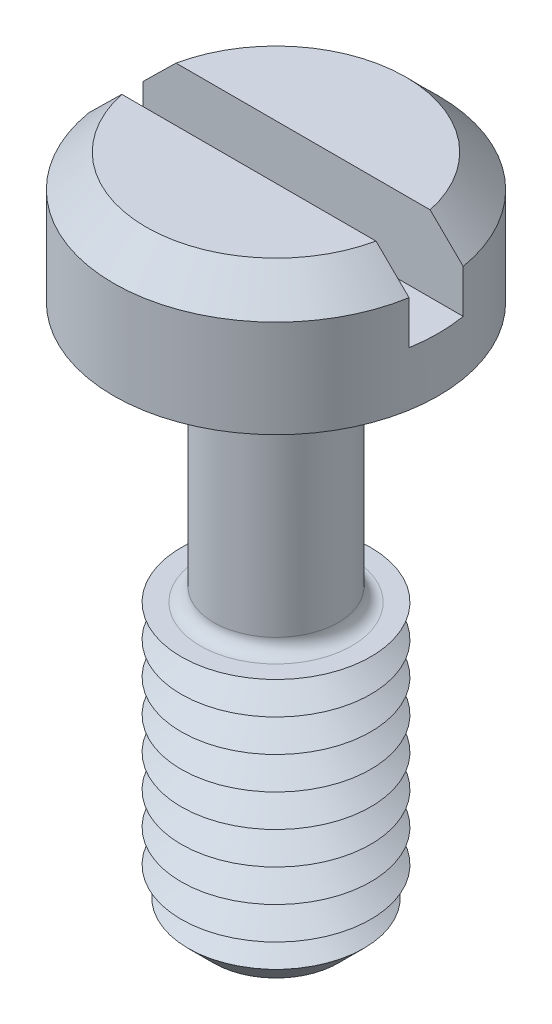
from build123d import *

# Parameters (mm, degrees)
SKETCH1_R           = 3
BOSS_EXTRUDE1_DEPTH = 2.4
SKETCH2_R           = 1.15
BOSS_EXTRUDE2_DEPTH = 10
SKETCH3_R           = 1.75
BOSS_EXTRUDE3_DEPTH = 5.2
CHAMFER1_SIZE       = 0.6
LPATTERN1_COUNT     = 8
LPATTERN1_PITCH     = 0.6
FILLET1_R           = 0.25
CHAMFER2_SIZE       = 0.6
SKETCH6_W           = 6
SKETCH6_H           = 1
CUT_EXTRUDE1_DEPTH  = 1.4


with BuildPart() as part:
    # Sketch1 → Boss-Extrude1 (new body)
    with BuildSketch(Plane(origin=(0, 0, 0), x_dir=(1, 0, 0), z_dir=(0, 1, 0))):
        with Locations(Location((0, 0, 0), (0, 0, 270))):
            Circle(SKETCH1_R)
    extrude(amount=BOSS_EXTRUDE1_DEPTH)

    # Sketch2 → Boss-Extrude2 (add)
    with BuildSketch(Plane.XZ):
        with Locations(Location((0, 0, 0), (0, 0, 270))):
            Circle(SKETCH2_R)
    extrude(amount=BOSS_EXTRUDE2_DEPTH)

    # Sketch3 → Boss-Extrude3 (add)
    with BuildSketch(Plane.XZ.offset(10)):
        with Locations(Location((0, 0, 0), (0, 0, 270))):
            Circle(SKETCH3_R)
    extrude(amount=-BOSS_EXTRUDE3_DEPTH)

    # Chamfer1
    chamfer1_edges = [part.edges().sort_by_distance(p)[0] for p in [
        (0, -10, 1.75),
    ]]
    chamfer(chamfer1_edges, length=CHAMFER1_SIZE)

    # Sketch5 → Cut-Revolve1 (revolve, cut)
    with BuildSketch(Plane(origin=(0, 0, 0), x_dir=(0, 0, -1), z_dir=(1, 0, 0))):
        Polygon((-1.75, -4.8), (-1.230384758, -5.1), (-1.75, -5.4), align=None)
    cut_revolve1 = revolve(axis=Axis((0, -6.58711856, 0), (0, -1, 0)), mode=Mode.SUBTRACT)

    # LPattern1: Cut-Revolve1 ×8
    with Locations(*[(0, -i * LPATTERN1_PITCH, 0) for i in range(1, LPATTERN1_COUNT)]):
        add(cut_revolve1, mode=Mode.SUBTRACT)

    # Fillet1
    fillet1_edges = [part.edges().sort_by_distance(p)[0] for p in [
        (0, 0, 1.15),
        (0, -4.8, 1.15),
    ]]
    fillet(fillet1_edges, radius=FILLET1_R)

    # Chamfer2
    chamfer2_edges = [part.edges().sort_by_distance(p)[0] for p in [
        (0, 2.4, -3),
    ]]
    chamfer(chamfer2_edges, length=CHAMFER2_SIZE)

    # Sketch6 → Cut-Extrude1 (cut)
    with BuildSketch(Plane(origin=(0, 2.4, 0), x_dir=(1, 0, 0), z_dir=(0, 1, 0))):
        Rectangle(SKETCH6_W, SKETCH6_H)
    extrude(amount=-CUT_EXTRUDE1_DEPTH, mode=Mode.SUBTRACT)


solid = part.part
